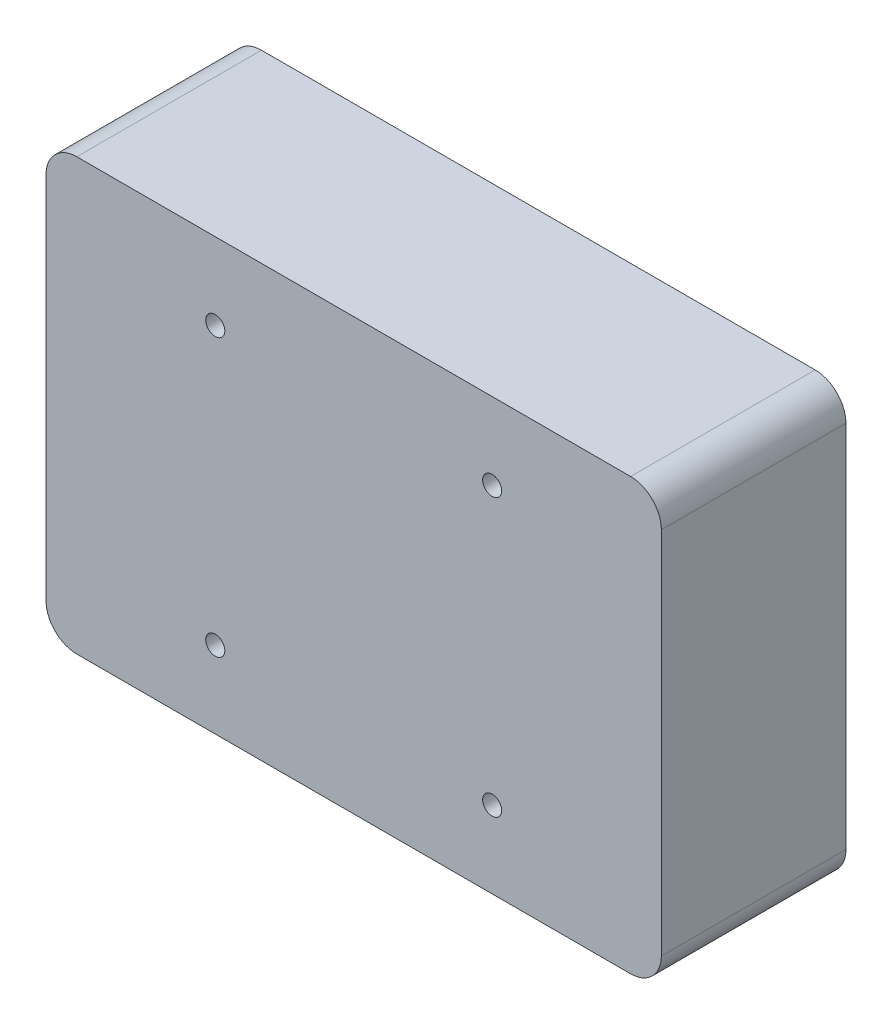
from build123d import *

# Parameters (mm, degrees)
SKETCH_1_W      = 100
SKETCH_1_H      = 70
SKETCH_1_R      = 1.55
EXTRUDE_1_DEPTH = 30
FILLET_1_R      = 5


with BuildPart() as part:
    # Sketch 1 → Extrude 1 (new body)
    with BuildSketch(Plane.XY):
        Rectangle(SKETCH_1_W, SKETCH_1_H)
        with Locations((-22.5, 22.5)):
            Circle(SKETCH_1_R, mode=Mode.SUBTRACT)
        with Locations((-22.5, -22.5)):
            Circle(SKETCH_1_R, mode=Mode.SUBTRACT)
        with Locations((22.5, -22.5)):
            Circle(SKETCH_1_R, mode=Mode.SUBTRACT)
        with Locations((22.5, 22.5)):
            Circle(SKETCH_1_R, mode=Mode.SUBTRACT)
    extrude(amount=EXTRUDE_1_DEPTH)

    # Fillet 1
    fillet_1_edges = [part.edges().sort_by_distance(p)[0] for p in [
        (50, -35, 15),
        (-50, -35, 15),
        (-50, 35, 15),
        (50, 35, 15),
    ]]
    fillet(fillet_1_edges, radius=FILLET_1_R)


solid = part.part
